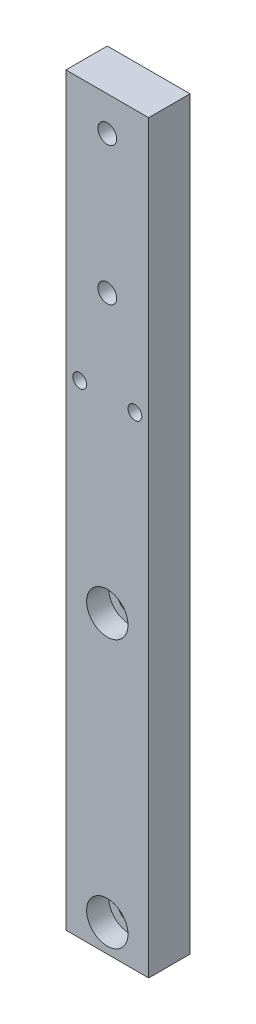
ISO-10303-21;
HEADER;
FILE_DESCRIPTION(('STEP AP214'),'2;1');
FILE_NAME('part.step','',(''),(''),'','','');
FILE_SCHEMA(('AUTOMOTIVE_DESIGN { 1 0 10303 214 1 1 1 1 }'));
ENDSEC;
DATA;
#1=APPLICATION_CONTEXT('core data for automotive mechanical design processes');
#2=APPLICATION_PROTOCOL_DEFINITION('international standard','automotive_design',2000,#1);
#3=PRODUCT_CONTEXT('',#1,'mechanical');
#4=PRODUCT('Part','Part','',(#3));
#5=PRODUCT_RELATED_PRODUCT_CATEGORY('part','',(#4));
#6=PRODUCT_DEFINITION_FORMATION('','',#4);
#7=PRODUCT_DEFINITION_CONTEXT('part definition',#1,'design');
#8=PRODUCT_DEFINITION('design','',#6,#7);
#9=PRODUCT_DEFINITION_SHAPE('','',#8);
#10=(LENGTH_UNIT() NAMED_UNIT(*) SI_UNIT(.MILLI.,.METRE.));
#11=(NAMED_UNIT(*) PLANE_ANGLE_UNIT() SI_UNIT($,.RADIAN.));
#12=(NAMED_UNIT(*) SI_UNIT($,.STERADIAN.) SOLID_ANGLE_UNIT());
#13=UNCERTAINTY_MEASURE_WITH_UNIT(LENGTH_MEASURE(1.E-05),#10,'distance_accuracy_value','');
#14=(GEOMETRIC_REPRESENTATION_CONTEXT(3) GLOBAL_UNCERTAINTY_ASSIGNED_CONTEXT((#13)) GLOBAL_UNIT_ASSIGNED_CONTEXT((#10,
#11,#12)) REPRESENTATION_CONTEXT('',''));
#15=CARTESIAN_POINT('',(0.,0.,0.));
#16=DIRECTION('',(0.,0.,1.));
#17=DIRECTION('',(1.,0.,0.));
#18=AXIS2_PLACEMENT_3D('',#15,#16,#17);
#19=CARTESIAN_POINT('',(-15.,270.,0.));
#20=DIRECTION('',(1.,0.,0.));
#21=DIRECTION('',(0.,0.,-1.));
#22=AXIS2_PLACEMENT_3D('',#19,#20,#21);
#23=PLANE('',#22);
#24=DIRECTION('',(0.,0.,1.));
#25=VECTOR('',#24,1.);
#26=CARTESIAN_POINT('',(-15.,0.,0.));
#27=LINE('',#26,#25);
#28=CARTESIAN_POINT('',(-15.,0.,-15.0000000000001));
#29=VERTEX_POINT('',#28);
#30=CARTESIAN_POINT('',(-15.,0.,0.));
#31=VERTEX_POINT('',#30);
#32=EDGE_CURVE('E110',#29,#31,#27,.T.);
#33=ORIENTED_EDGE('',*,*,#32,.T.);
#34=DIRECTION('',(0.,-1.,0.));
#35=VECTOR('',#34,1.);
#36=CARTESIAN_POINT('',(-15.,270.,0.));
#37=LINE('',#36,#35);
#38=CARTESIAN_POINT('',(-15.,270.,0.));
#39=VERTEX_POINT('',#38);
#40=EDGE_CURVE('E11',#39,#31,#37,.T.);
#41=ORIENTED_EDGE('',*,*,#40,.F.);
#42=DIRECTION('',(0.,0.,1.));
#43=VECTOR('',#42,1.);
#44=CARTESIAN_POINT('',(-15.,270.,0.));
#45=LINE('',#44,#43);
#46=CARTESIAN_POINT('',(-15.,270.,-15.));
#47=VERTEX_POINT('',#46);
#48=EDGE_CURVE('E92',#47,#39,#45,.T.);
#49=ORIENTED_EDGE('',*,*,#48,.F.);
#50=DIRECTION('',(0.,-1.,0.));
#51=VECTOR('',#50,1.);
#52=CARTESIAN_POINT('',(-15.,270.,-15.));
#53=LINE('',#52,#51);
#54=EDGE_CURVE('E106',#47,#29,#53,.T.);
#55=ORIENTED_EDGE('',*,*,#54,.T.);
#56=EDGE_LOOP('',(#33,#41,#49,#55));
#57=FACE_BOUND('',#56,.T.);
#58=ADVANCED_FACE('F40',(#57),#23,.F.);
#59=CARTESIAN_POINT('',(-15.,270.,0.));
#60=DIRECTION('',(0.,0.,-1.));
#61=DIRECTION('',(-1.,0.,0.));
#62=AXIS2_PLACEMENT_3D('',#59,#60,#61);
#63=PLANE('',#62);
#64=CARTESIAN_POINT('',(-10.,175.,0.));
#65=DIRECTION('',(0.,0.,1.));
#66=DIRECTION('',(1.,0.,0.));
#67=AXIS2_PLACEMENT_3D('',#64,#65,#66);
#68=CIRCLE('',#67,2.49999999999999);
#69=CARTESIAN_POINT('',(-7.50000000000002,175.,0.));
#70=VERTEX_POINT('',#69);
#71=EDGE_CURVE('E184',#70,#70,#68,.T.);
#72=ORIENTED_EDGE('',*,*,#71,.F.);
#73=EDGE_LOOP('',(#72));
#74=FACE_BOUND('',#73,.T.);
#75=CARTESIAN_POINT('',(9.99999999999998,175.,0.));
#76=DIRECTION('',(0.,0.,1.));
#77=DIRECTION('',(1.,0.,0.));
#78=AXIS2_PLACEMENT_3D('',#75,#76,#77);
#79=CIRCLE('',#78,2.49999999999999);
#80=CARTESIAN_POINT('',(12.5,175.,0.));
#81=VERTEX_POINT('',#80);
#82=EDGE_CURVE('E177',#81,#81,#79,.T.);
#83=ORIENTED_EDGE('',*,*,#82,.F.);
#84=EDGE_LOOP('',(#83));
#85=FACE_BOUND('',#84,.T.);
#86=CARTESIAN_POINT('',(0.,257.5,0.));
#87=DIRECTION('',(0.,0.,1.));
#88=DIRECTION('',(1.,0.,0.));
#89=AXIS2_PLACEMENT_3D('',#86,#87,#88);
#90=CIRCLE('',#89,3.39999999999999);
#91=CARTESIAN_POINT('',(3.39999999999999,257.5,0.));
#92=VERTEX_POINT('',#91);
#93=EDGE_CURVE('E169',#92,#92,#90,.T.);
#94=ORIENTED_EDGE('',*,*,#93,.F.);
#95=EDGE_LOOP('',(#94));
#96=FACE_BOUND('',#95,.T.);
#97=CARTESIAN_POINT('',(0.,207.5,0.));
#98=DIRECTION('',(0.,0.,1.));
#99=DIRECTION('',(1.,0.,0.));
#100=AXIS2_PLACEMENT_3D('',#97,#98,#99);
#101=CIRCLE('',#100,3.39999999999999);
#102=CARTESIAN_POINT('',(3.40000000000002,207.5,0.));
#103=VERTEX_POINT('',#102);
#104=EDGE_CURVE('E162',#103,#103,#101,.T.);
#105=ORIENTED_EDGE('',*,*,#104,.F.);
#106=EDGE_LOOP('',(#105));
#107=FACE_BOUND('',#106,.T.);
#108=CARTESIAN_POINT('',(0.,107.,0.));
#109=DIRECTION('',(0.,0.,1.));
#110=DIRECTION('',(1.,0.,0.));
#111=AXIS2_PLACEMENT_3D('',#108,#109,#110);
#112=CIRCLE('',#111,7.5);
#113=CARTESIAN_POINT('',(7.50000000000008,107.,0.));
#114=VERTEX_POINT('',#113);
#115=EDGE_CURVE('E147',#114,#114,#112,.T.);
#116=ORIENTED_EDGE('',*,*,#115,.F.);
#117=EDGE_LOOP('',(#116));
#118=FACE_BOUND('',#117,.T.);
#119=CARTESIAN_POINT('',(0.,10.,0.));
#120=DIRECTION('',(0.,0.,1.));
#121=DIRECTION('',(1.,0.,0.));
#122=AXIS2_PLACEMENT_3D('',#119,#120,#121);
#123=CIRCLE('',#122,7.5);
#124=CARTESIAN_POINT('',(7.5,10.,0.));
#125=VERTEX_POINT('',#124);
#126=EDGE_CURVE('E114',#125,#125,#123,.T.);
#127=ORIENTED_EDGE('',*,*,#126,.F.);
#128=EDGE_LOOP('',(#127));
#129=FACE_BOUND('',#128,.T.);
#130=DIRECTION('',(1.,0.,0.));
#131=VECTOR('',#130,1.);
#132=CARTESIAN_POINT('',(-15.,0.,0.));
#133=LINE('',#132,#131);
#134=CARTESIAN_POINT('',(15.,0.,0.));
#135=VERTEX_POINT('',#134);
#136=EDGE_CURVE('E97',#31,#135,#133,.T.);
#137=ORIENTED_EDGE('',*,*,#136,.T.);
#138=DIRECTION('',(0.,-1.,0.));
#139=VECTOR('',#138,1.);
#140=CARTESIAN_POINT('',(15.,270.,0.));
#141=LINE('',#140,#139);
#142=CARTESIAN_POINT('',(15.,270.,0.));
#143=VERTEX_POINT('',#142);
#144=EDGE_CURVE('E49',#143,#135,#141,.T.);
#145=ORIENTED_EDGE('',*,*,#144,.F.);
#146=DIRECTION('',(1.,0.,0.));
#147=VECTOR('',#146,1.);
#148=CARTESIAN_POINT('',(-15.,270.,0.));
#149=LINE('',#148,#147);
#150=EDGE_CURVE('E87',#39,#143,#149,.T.);
#151=ORIENTED_EDGE('',*,*,#150,.F.);
#152=ORIENTED_EDGE('',*,*,#40,.T.);
#153=EDGE_LOOP('',(#137,#145,#151,#152));
#154=FACE_BOUND('',#153,.T.);
#155=ADVANCED_FACE('F96',(#74,#85,#96,#107,#118,#129,#154),#63,.F.);
#156=CARTESIAN_POINT('',(15.,270.,0.));
#157=DIRECTION('',(-1.,0.,0.));
#158=DIRECTION('',(0.,0.,1.));
#159=AXIS2_PLACEMENT_3D('',#156,#157,#158);
#160=PLANE('',#159);
#161=DIRECTION('',(0.,0.,-1.));
#162=VECTOR('',#161,1.);
#163=CARTESIAN_POINT('',(15.,0.,0.));
#164=LINE('',#163,#162);
#165=CARTESIAN_POINT('',(15.,-1.11022302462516E-13,-15.0000000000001));
#166=VERTEX_POINT('',#165);
#167=EDGE_CURVE('E74',#135,#166,#164,.T.);
#168=ORIENTED_EDGE('',*,*,#167,.T.);
#169=DIRECTION('',(0.,-1.,0.));
#170=VECTOR('',#169,1.);
#171=CARTESIAN_POINT('',(15.,270.,-15.));
#172=LINE('',#171,#170);
#173=CARTESIAN_POINT('',(15.,270.,-15.));
#174=VERTEX_POINT('',#173);
#175=EDGE_CURVE('E99',#174,#166,#172,.T.);
#176=ORIENTED_EDGE('',*,*,#175,.F.);
#177=DIRECTION('',(0.,0.,-1.));
#178=VECTOR('',#177,1.);
#179=CARTESIAN_POINT('',(15.,270.,0.));
#180=LINE('',#179,#178);
#181=EDGE_CURVE('E90',#143,#174,#180,.T.);
#182=ORIENTED_EDGE('',*,*,#181,.F.);
#183=ORIENTED_EDGE('',*,*,#144,.T.);
#184=EDGE_LOOP('',(#168,#176,#182,#183));
#185=FACE_BOUND('',#184,.T.);
#186=ADVANCED_FACE('F100',(#185),#160,.F.);
#187=CARTESIAN_POINT('',(-15.,270.,-15.));
#188=DIRECTION('',(0.,0.,1.));
#189=DIRECTION('',(1.,0.,0.));
#190=AXIS2_PLACEMENT_3D('',#187,#188,#189);
#191=PLANE('',#190);
#192=CARTESIAN_POINT('',(-10.,175.,-15.0000000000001));
#193=DIRECTION('',(0.,0.,1.));
#194=DIRECTION('',(1.,0.,0.));
#195=AXIS2_PLACEMENT_3D('',#192,#193,#194);
#196=CIRCLE('',#195,2.5);
#197=CARTESIAN_POINT('',(-7.50000000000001,175.,-15.0000000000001));
#198=VERTEX_POINT('',#197);
#199=EDGE_CURVE('E188',#198,#198,#196,.T.);
#200=ORIENTED_EDGE('',*,*,#199,.T.);
#201=EDGE_LOOP('',(#200));
#202=FACE_BOUND('',#201,.T.);
#203=CARTESIAN_POINT('',(10.,175.,-15.));
#204=DIRECTION('',(0.,0.,1.));
#205=DIRECTION('',(1.,0.,0.));
#206=AXIS2_PLACEMENT_3D('',#203,#204,#205);
#207=CIRCLE('',#206,2.5);
#208=CARTESIAN_POINT('',(12.5,175.,-15.));
#209=VERTEX_POINT('',#208);
#210=EDGE_CURVE('E181',#209,#209,#207,.T.);
#211=ORIENTED_EDGE('',*,*,#210,.T.);
#212=EDGE_LOOP('',(#211));
#213=FACE_BOUND('',#212,.T.);
#214=CARTESIAN_POINT('',(0.,257.5,-15.));
#215=DIRECTION('',(0.,0.,1.));
#216=DIRECTION('',(1.,0.,0.));
#217=AXIS2_PLACEMENT_3D('',#214,#215,#216);
#218=CIRCLE('',#217,3.4);
#219=CARTESIAN_POINT('',(3.4,257.5,-15.));
#220=VERTEX_POINT('',#219);
#221=EDGE_CURVE('E173',#220,#220,#218,.T.);
#222=ORIENTED_EDGE('',*,*,#221,.T.);
#223=EDGE_LOOP('',(#222));
#224=FACE_BOUND('',#223,.T.);
#225=CARTESIAN_POINT('',(0.,207.5,-15.0000000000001));
#226=DIRECTION('',(0.,0.,1.));
#227=DIRECTION('',(1.,0.,0.));
#228=AXIS2_PLACEMENT_3D('',#225,#226,#227);
#229=CIRCLE('',#228,3.4);
#230=CARTESIAN_POINT('',(3.40000000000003,207.5,-15.0000000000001));
#231=VERTEX_POINT('',#230);
#232=EDGE_CURVE('E166',#231,#231,#229,.T.);
#233=ORIENTED_EDGE('',*,*,#232,.T.);
#234=EDGE_LOOP('',(#233));
#235=FACE_BOUND('',#234,.T.);
#236=CARTESIAN_POINT('',(0.,107.,-15.0000000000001));
#237=DIRECTION('',(0.,0.,1.));
#238=DIRECTION('',(1.,0.,0.));
#239=AXIS2_PLACEMENT_3D('',#236,#237,#238);
#240=CIRCLE('',#239,4.25);
#241=CARTESIAN_POINT('',(4.25,107.,-15.0000000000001));
#242=VERTEX_POINT('',#241);
#243=EDGE_CURVE('E158',#242,#242,#240,.T.);
#244=ORIENTED_EDGE('',*,*,#243,.T.);
#245=EDGE_LOOP('',(#244));
#246=FACE_BOUND('',#245,.T.);
#247=CARTESIAN_POINT('',(0.,10.,-15.0000000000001));
#248=DIRECTION('',(0.,0.,1.));
#249=DIRECTION('',(1.,0.,0.));
#250=AXIS2_PLACEMENT_3D('',#247,#248,#249);
#251=CIRCLE('',#250,4.25);
#252=CARTESIAN_POINT('',(4.25000000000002,10.,-15.0000000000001));
#253=VERTEX_POINT('',#252);
#254=EDGE_CURVE('E144',#253,#253,#251,.T.);
#255=ORIENTED_EDGE('',*,*,#254,.T.);
#256=EDGE_LOOP('',(#255));
#257=FACE_BOUND('',#256,.T.);
#258=DIRECTION('',(-1.,0.,0.));
#259=VECTOR('',#258,1.);
#260=CARTESIAN_POINT('',(-15.,0.,-15.0000000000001));
#261=LINE('',#260,#259);
#262=EDGE_CURVE('E80',#166,#29,#261,.T.);
#263=ORIENTED_EDGE('',*,*,#262,.T.);
#264=ORIENTED_EDGE('',*,*,#54,.F.);
#265=DIRECTION('',(-1.,0.,0.));
#266=VECTOR('',#265,1.);
#267=CARTESIAN_POINT('',(-15.,270.,-15.));
#268=LINE('',#267,#266);
#269=EDGE_CURVE('E57',#174,#47,#268,.T.);
#270=ORIENTED_EDGE('',*,*,#269,.F.);
#271=ORIENTED_EDGE('',*,*,#175,.T.);
#272=EDGE_LOOP('',(#263,#264,#270,#271));
#273=FACE_BOUND('',#272,.T.);
#274=ADVANCED_FACE('F126',(#202,#213,#224,#235,#246,#257,#273),#191,.F.);
#275=CARTESIAN_POINT('',(-15.,270.,-15.));
#276=DIRECTION('',(0.,-1.,0.));
#277=DIRECTION('',(0.,0.,-1.));
#278=AXIS2_PLACEMENT_3D('',#275,#276,#277);
#279=PLANE('',#278);
#280=ORIENTED_EDGE('',*,*,#48,.T.);
#281=ORIENTED_EDGE('',*,*,#150,.T.);
#282=ORIENTED_EDGE('',*,*,#181,.T.);
#283=ORIENTED_EDGE('',*,*,#269,.T.);
#284=EDGE_LOOP('',(#280,#281,#282,#283));
#285=FACE_BOUND('',#284,.T.);
#286=ADVANCED_FACE('F88',(#285),#279,.F.);
#287=CARTESIAN_POINT('',(-15.,0.,-15.0000000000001));
#288=DIRECTION('',(0.,-1.,0.));
#289=DIRECTION('',(0.,0.,-1.));
#290=AXIS2_PLACEMENT_3D('',#287,#288,#289);
#291=PLANE('',#290);
#292=ORIENTED_EDGE('',*,*,#32,.F.);
#293=ORIENTED_EDGE('',*,*,#262,.F.);
#294=ORIENTED_EDGE('',*,*,#167,.F.);
#295=ORIENTED_EDGE('',*,*,#136,.F.);
#296=EDGE_LOOP('',(#292,#293,#294,#295));
#297=FACE_BOUND('',#296,.T.);
#298=ADVANCED_FACE('F129',(#297),#291,.T.);
#299=CARTESIAN_POINT('',(0.,10.,0.));
#300=DIRECTION('',(0.,0.,1.));
#301=DIRECTION('',(1.,0.,0.));
#302=AXIS2_PLACEMENT_3D('',#299,#300,#301);
#303=CYLINDRICAL_SURFACE('',#302,7.5);
#304=CARTESIAN_POINT('',(0.,10.,-8.00000000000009));
#305=DIRECTION('',(0.,0.,1.));
#306=DIRECTION('',(1.,0.,0.));
#307=AXIS2_PLACEMENT_3D('',#304,#305,#306);
#308=CIRCLE('',#307,7.5);
#309=CARTESIAN_POINT('',(7.5,10.,-8.00000000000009));
#310=VERTEX_POINT('',#309);
#311=EDGE_CURVE('E137',#310,#310,#308,.T.);
#312=ORIENTED_EDGE('',*,*,#311,.F.);
#313=EDGE_LOOP('',(#312));
#314=FACE_BOUND('',#313,.T.);
#315=ORIENTED_EDGE('',*,*,#126,.T.);
#316=EDGE_LOOP('',(#315));
#317=FACE_BOUND('',#316,.T.);
#318=ADVANCED_FACE('F214',(#314,#317),#303,.F.);
#319=CARTESIAN_POINT('',(4.25,10.,-8.00000000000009));
#320=DIRECTION('',(0.,0.,-1.));
#321=DIRECTION('',(-1.,0.,0.));
#322=AXIS2_PLACEMENT_3D('',#319,#320,#321);
#323=PLANE('',#322);
#324=CARTESIAN_POINT('',(0.,10.,-8.00000000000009));
#325=DIRECTION('',(0.,0.,1.));
#326=DIRECTION('',(1.,0.,0.));
#327=AXIS2_PLACEMENT_3D('',#324,#325,#326);
#328=CIRCLE('',#327,4.25);
#329=CARTESIAN_POINT('',(4.25,10.,-8.00000000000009));
#330=VERTEX_POINT('',#329);
#331=EDGE_CURVE('E140',#330,#330,#328,.T.);
#332=ORIENTED_EDGE('',*,*,#331,.F.);
#333=EDGE_LOOP('',(#332));
#334=FACE_BOUND('',#333,.T.);
#335=ORIENTED_EDGE('',*,*,#311,.T.);
#336=EDGE_LOOP('',(#335));
#337=FACE_BOUND('',#336,.T.);
#338=ADVANCED_FACE('F216',(#334,#337),#323,.F.);
#339=CARTESIAN_POINT('',(0.,10.,0.));
#340=DIRECTION('',(0.,0.,1.));
#341=DIRECTION('',(1.,0.,0.));
#342=AXIS2_PLACEMENT_3D('',#339,#340,#341);
#343=CYLINDRICAL_SURFACE('',#342,4.25);
#344=ORIENTED_EDGE('',*,*,#254,.F.);
#345=EDGE_LOOP('',(#344));
#346=FACE_BOUND('',#345,.T.);
#347=ORIENTED_EDGE('',*,*,#331,.T.);
#348=EDGE_LOOP('',(#347));
#349=FACE_BOUND('',#348,.T.);
#350=ADVANCED_FACE('F223',(#346,#349),#343,.F.);
#351=CARTESIAN_POINT('',(0.,107.,0.));
#352=DIRECTION('',(0.,0.,1.));
#353=DIRECTION('',(1.,0.,0.));
#354=AXIS2_PLACEMENT_3D('',#351,#352,#353);
#355=CYLINDRICAL_SURFACE('',#354,7.5);
#356=CARTESIAN_POINT('',(0.,107.,-8.00000000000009));
#357=DIRECTION('',(0.,0.,1.));
#358=DIRECTION('',(1.,0.,0.));
#359=AXIS2_PLACEMENT_3D('',#356,#357,#358);
#360=CIRCLE('',#359,7.5);
#361=CARTESIAN_POINT('',(7.5,107.,-8.00000000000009));
#362=VERTEX_POINT('',#361);
#363=EDGE_CURVE('E150',#362,#362,#360,.T.);
#364=ORIENTED_EDGE('',*,*,#363,.F.);
#365=EDGE_LOOP('',(#364));
#366=FACE_BOUND('',#365,.T.);
#367=ORIENTED_EDGE('',*,*,#115,.T.);
#368=EDGE_LOOP('',(#367));
#369=FACE_BOUND('',#368,.T.);
#370=ADVANCED_FACE('F273',(#366,#369),#355,.F.);
#371=CARTESIAN_POINT('',(4.25,107.,-8.00000000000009));
#372=DIRECTION('',(0.,0.,-1.));
#373=DIRECTION('',(-1.,0.,0.));
#374=AXIS2_PLACEMENT_3D('',#371,#372,#373);
#375=PLANE('',#374);
#376=CARTESIAN_POINT('',(0.,107.,-8.00000000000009));
#377=DIRECTION('',(0.,0.,1.));
#378=DIRECTION('',(1.,0.,0.));
#379=AXIS2_PLACEMENT_3D('',#376,#377,#378);
#380=CIRCLE('',#379,4.25);
#381=CARTESIAN_POINT('',(4.25,107.,-8.00000000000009));
#382=VERTEX_POINT('',#381);
#383=EDGE_CURVE('E154',#382,#382,#380,.T.);
#384=ORIENTED_EDGE('',*,*,#383,.F.);
#385=EDGE_LOOP('',(#384));
#386=FACE_BOUND('',#385,.T.);
#387=ORIENTED_EDGE('',*,*,#363,.T.);
#388=EDGE_LOOP('',(#387));
#389=FACE_BOUND('',#388,.T.);
#390=ADVANCED_FACE('F282',(#386,#389),#375,.F.);
#391=CARTESIAN_POINT('',(0.,107.,0.));
#392=DIRECTION('',(0.,0.,1.));
#393=DIRECTION('',(1.,0.,0.));
#394=AXIS2_PLACEMENT_3D('',#391,#392,#393);
#395=CYLINDRICAL_SURFACE('',#394,4.25);
#396=ORIENTED_EDGE('',*,*,#243,.F.);
#397=EDGE_LOOP('',(#396));
#398=FACE_BOUND('',#397,.T.);
#399=ORIENTED_EDGE('',*,*,#383,.T.);
#400=EDGE_LOOP('',(#399));
#401=FACE_BOUND('',#400,.T.);
#402=ADVANCED_FACE('F291',(#398,#401),#395,.F.);
#403=CARTESIAN_POINT('',(0.,207.5,0.));
#404=DIRECTION('',(0.,0.,1.));
#405=DIRECTION('',(1.,0.,0.));
#406=AXIS2_PLACEMENT_3D('',#403,#404,#405);
#407=CYLINDRICAL_SURFACE('',#406,3.39999999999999);
#408=ORIENTED_EDGE('',*,*,#232,.F.);
#409=EDGE_LOOP('',(#408));
#410=FACE_BOUND('',#409,.T.);
#411=ORIENTED_EDGE('',*,*,#104,.T.);
#412=EDGE_LOOP('',(#411));
#413=FACE_BOUND('',#412,.T.);
#414=ADVANCED_FACE('F300',(#410,#413),#407,.F.);
#415=CARTESIAN_POINT('',(0.,257.5,0.));
#416=DIRECTION('',(0.,0.,1.));
#417=DIRECTION('',(1.,0.,0.));
#418=AXIS2_PLACEMENT_3D('',#415,#416,#417);
#419=CYLINDRICAL_SURFACE('',#418,3.39999999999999);
#420=ORIENTED_EDGE('',*,*,#221,.F.);
#421=EDGE_LOOP('',(#420));
#422=FACE_BOUND('',#421,.T.);
#423=ORIENTED_EDGE('',*,*,#93,.T.);
#424=EDGE_LOOP('',(#423));
#425=FACE_BOUND('',#424,.T.);
#426=ADVANCED_FACE('F310',(#422,#425),#419,.F.);
#427=CARTESIAN_POINT('',(9.99999999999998,175.,0.));
#428=DIRECTION('',(0.,0.,1.));
#429=DIRECTION('',(1.,0.,0.));
#430=AXIS2_PLACEMENT_3D('',#427,#428,#429);
#431=CYLINDRICAL_SURFACE('',#430,2.49999999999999);
#432=ORIENTED_EDGE('',*,*,#210,.F.);
#433=EDGE_LOOP('',(#432));
#434=FACE_BOUND('',#433,.T.);
#435=ORIENTED_EDGE('',*,*,#82,.T.);
#436=EDGE_LOOP('',(#435));
#437=FACE_BOUND('',#436,.T.);
#438=ADVANCED_FACE('F198',(#434,#437),#431,.F.);
#439=CARTESIAN_POINT('',(-10.,175.,0.));
#440=DIRECTION('',(0.,0.,1.));
#441=DIRECTION('',(1.,0.,0.));
#442=AXIS2_PLACEMENT_3D('',#439,#440,#441);
#443=CYLINDRICAL_SURFACE('',#442,2.49999999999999);
#444=ORIENTED_EDGE('',*,*,#199,.F.);
#445=EDGE_LOOP('',(#444));
#446=FACE_BOUND('',#445,.T.);
#447=ORIENTED_EDGE('',*,*,#71,.T.);
#448=EDGE_LOOP('',(#447));
#449=FACE_BOUND('',#448,.T.);
#450=ADVANCED_FACE('F195',(#446,#449),#443,.F.);
#451=CLOSED_SHELL('',(#58,#155,#186,#274,#286,#298,#318,#338,#350,#370,#390,#402,#414,#426,#438,#450));
#452=MANIFOLD_SOLID_BREP('B2',#451);
#453=ADVANCED_BREP_SHAPE_REPRESENTATION('',(#18,#452),#14);
#454=SHAPE_DEFINITION_REPRESENTATION(#9,#453);
ENDSEC;
END-ISO-10303-21;
